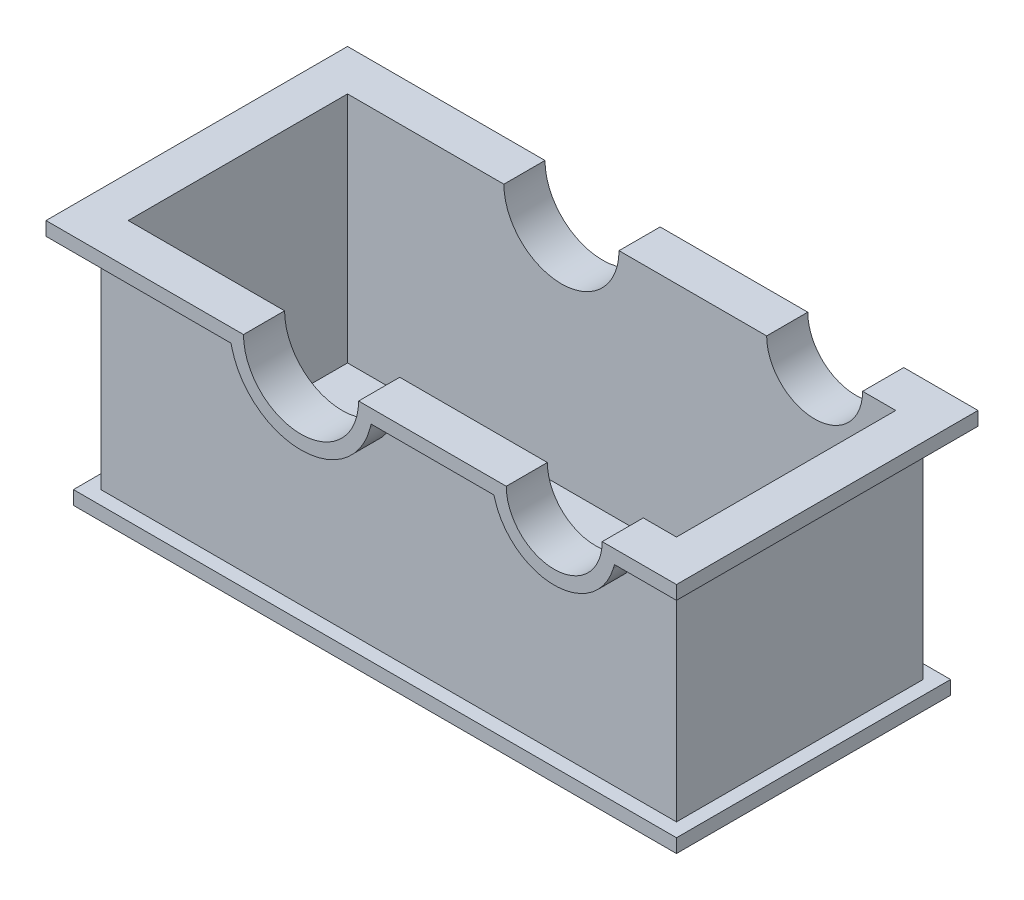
from build123d import *

# Parameters (mm, degrees)
SKETCH1_W           = 220
SKETCH1_H           = 100
BOSS_EXTRUDE2_DEPTH = 5
SKETCH3_W           = 210
SKETCH3_H           = 90
SKETCH3_W_2         = 200
SKETCH3_H_2         = 80
BOSS_EXTRUDE3_DEPTH = 80
SKETCH4_W           = 230
SKETCH4_H           = 110
SKETCH4_W_2         = 200
SKETCH4_H_2         = 80
BOSS_EXTRUDE4_DEPTH = 5
SKETCH5_R           = 21
SKETCH5_R_2         = 17.5
CUT_EXTRUDE1_DEPTH  = 262.916017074
BOSS_EXTRUDE6_START = 10
BOSS_EXTRUDE6_DEPTH = 10
BOSS_EXTRUDE7_DEPTH = 10


with BuildPart() as part:
    # Sketch1 → Boss-Extrude2 (new body)
    with BuildSketch(Plane(origin=(0, 0, 0), x_dir=(1, 0, 0), z_dir=(0, 1, 0))):
        with Locations((105, 45)):
            Rectangle(SKETCH1_W, SKETCH1_H)
    extrude(amount=BOSS_EXTRUDE2_DEPTH)

    # Sketch3 → Boss-Extrude3 (add)
    with BuildSketch(Plane(origin=(0, 5, 0), x_dir=(1, 0, 0), z_dir=(0, 1, 0))):
        with Locations((105, 45)):
            Rectangle(SKETCH3_W, SKETCH3_H)
        with Locations((105, 45)):
            Rectangle(SKETCH3_W_2, SKETCH3_H_2, mode=Mode.SUBTRACT)
    extrude(amount=BOSS_EXTRUDE3_DEPTH)

    # Sketch4 → Boss-Extrude4 (add)
    with BuildSketch(Plane(origin=(0, 85, 0), x_dir=(1, 0, 0), z_dir=(0, 1, 0))):
        with Locations((105, 45)):
            Rectangle(SKETCH4_W, SKETCH4_H)
        with Locations((105, 45)):
            Rectangle(SKETCH4_W_2, SKETCH4_H_2, mode=Mode.SUBTRACT)
    extrude(amount=BOSS_EXTRUDE4_DEPTH)

    # Sketch5 → Cut-Extrude1 (cut, through all)
    with BuildSketch(Plane.XY.offset(10)):
        with Locations((83.039365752, 90)):
            Circle(SKETCH5_R)
        with Locations((175.399365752, 90)):
            Circle(SKETCH5_R_2)
    extrude(amount=-CUT_EXTRUDE1_DEPTH, mode=Mode.SUBTRACT)

    # Sketch6 → Boss-Extrude6 (add)
    with BuildSketch(Plane.XY.offset(BOSS_EXTRUDE6_START)):
        with BuildLine():
            Line((57.787078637, 83.80952381), (57.49523915, 85))
            Line((57.49523915, 85), (62.643287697, 85))
            ThreePointArc((62.643287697, 85), (83.039365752, 69), (103.435443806, 85))
            Line((103.435443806, 85), (108.583492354, 85))
            Line((108.583492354, 85), (108.291652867, 83.80952381))
            ThreePointArc((108.291652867, 83.80952381), (83.039365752, 64), (57.787078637, 83.80952381))
        make_face()
        with BuildLine():
            Line((153.837281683, 83.571428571), (153.411363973, 85))
            Line((153.411363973, 85), (158.628855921, 85))
            ThreePointArc((158.628855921, 85), (175.399365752, 72.5), (192.169875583, 85))
            Line((192.169875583, 85), (197.387367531, 85))
            Line((197.387367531, 85), (196.961449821, 83.571428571))
            ThreePointArc((196.961449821, 83.571428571), (175.399365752, 67.5), (153.837281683, 83.571428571))
        make_face()
    extrude(amount=-BOSS_EXTRUDE6_DEPTH)

    # Sketch8 → Boss-Extrude7 (add)
    with BuildSketch(Plane(origin=(0, 0, -90), x_dir=(-1, 0, 0), z_dir=(0, 0, -1))):
        with BuildLine():
            Line((-108.583492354, 85), (-103.435443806, 85))
            ThreePointArc((-103.435443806, 85), (-83.039365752, 69), (-62.643287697, 85))
            Line((-62.643287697, 85), (-57.49523915, 85))
            Line((-57.49523915, 85), (-57.787078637, 83.80952381))
            ThreePointArc((-57.787078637, 83.80952381), (-83.039365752, 64), (-108.291652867, 83.80952381))
            Line((-108.291652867, 83.80952381), (-108.583492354, 85))
        make_face()
        with BuildLine():
            Line((-196.961449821, 83.571428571), (-197.387367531, 85))
            Line((-197.387367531, 85), (-192.169875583, 85))
            ThreePointArc((-192.169875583, 85), (-175.399365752, 72.5), (-158.628855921, 85))
            Line((-158.628855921, 85), (-153.411363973, 85))
            Line((-153.411363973, 85), (-153.837281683, 83.571428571))
            ThreePointArc((-153.837281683, 83.571428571), (-175.399365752, 67.5), (-196.961449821, 83.571428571))
        make_face()
    extrude(amount=BOSS_EXTRUDE7_DEPTH)


solid = part.part
